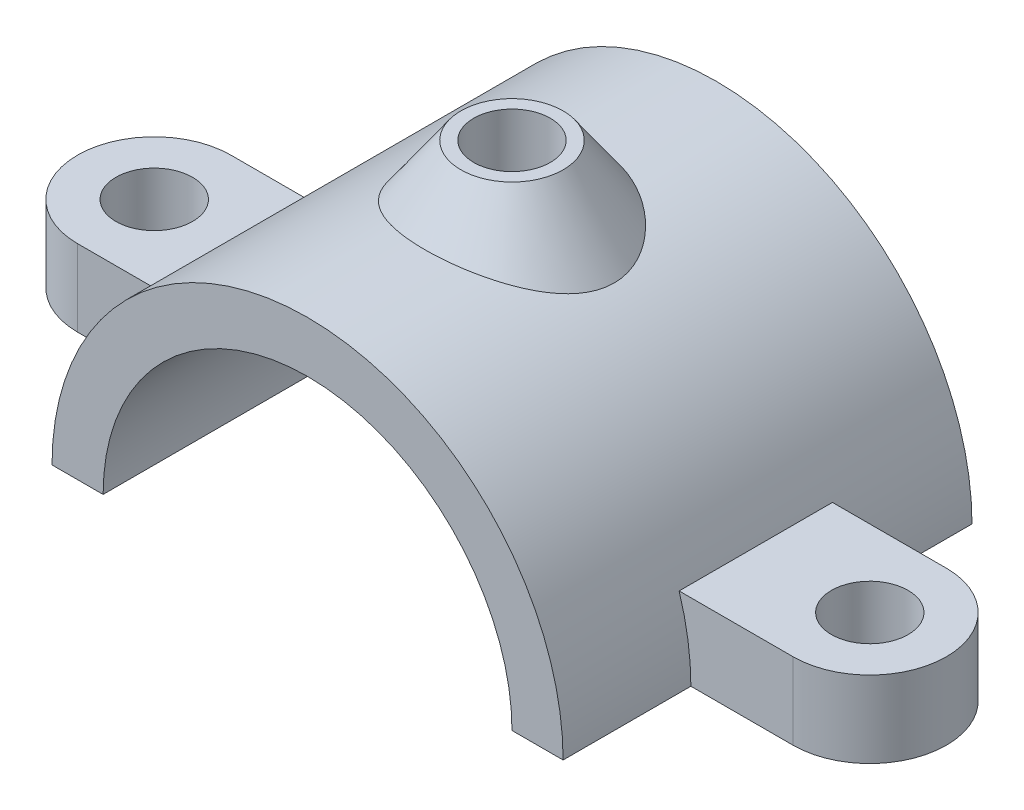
from build123d import *

# Parameters (mm, degrees)
EXTRUDE1_DEPTH      = 40
SKETCH_2_R          = 7.5
CUT_EXTRUDE_1_DEPTH = 88.74964404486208
SKETCH_3_R          = 7.500000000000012
EXTRUDE_1_DEPTH     = 15


with BuildPart() as part:
    # Sketch1 → Extrude1 (new, symmetric)
    with BuildSketch(Plane.XY):
        with BuildLine():
            Line((50, 0), (40, 0))
            ThreePointArc((40, 0), (2.45e-15, 40), (-40, 0))
            Line((-40, 0), (-50, 0))
            ThreePointArc((-50, 0), (3.06e-15, 50), (50, 0))
        make_face()
    extrude(amount=EXTRUDE1_DEPTH, both=True)

    # Sketch 1 → Revolve 1 (revolve)
    with BuildSketch(Plane.XY, mode=Mode.PRIVATE) as revolve_1_sk:
        with BuildLine():
            Line((2.7e-16, 60), (-10, 60))
            Line((-10, 60), (-20, 45.825756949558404))
            ThreePointArc((-20, 45.825756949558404), (-10.215482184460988, 48.945315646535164), (0, 50))
            Line((0, 50), (2.7e-16, 60))
        make_face()
    revolve(revolve_1_sk.sketch.rotate(Axis((0, 0, 0), (0, 1, 0)), 270), axis=Axis((0, 0, 0), (0, 1, 0)))

    # Sketch 2 → Cut-Extrude 1 (cut, through all)
    with BuildSketch(Plane(origin=(0, 60, 0), x_dir=(1, 0, 0), z_dir=(0, 1, 0))):
        with Locations(Location((0, 0, 0), (0, 0, 270))):
            Circle(SKETCH_2_R)
    extrude(amount=-CUT_EXTRUDE_1_DEPTH, mode=Mode.SUBTRACT)

    # Sketch 3 → Extrude 1 (add)
    with BuildSketch(Plane.XZ):
        with BuildLine():
            Line((40.00000000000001, 15), (40.00000000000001, -15))
            Line((40.00000000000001, -15), (70, -15))
            ThreePointArc((70, -15), (85, 0), (70, 15))
            Line((70, 15), (40.00000000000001, 15))
        make_face()
        with Locations(Location((70, 0, 0), (0, 0, 270))):
            Circle(SKETCH_3_R, mode=Mode.SUBTRACT)
    extrude_1 = extrude(amount=-EXTRUDE_1_DEPTH)

    # Mirror 1: Extrude 1 across plane
    add(extrude_1.mirror(Plane(origin=(0, 0, 0), x_dir=(0, 0, 1), z_dir=(1, 0, 0))))


solid = part.part
